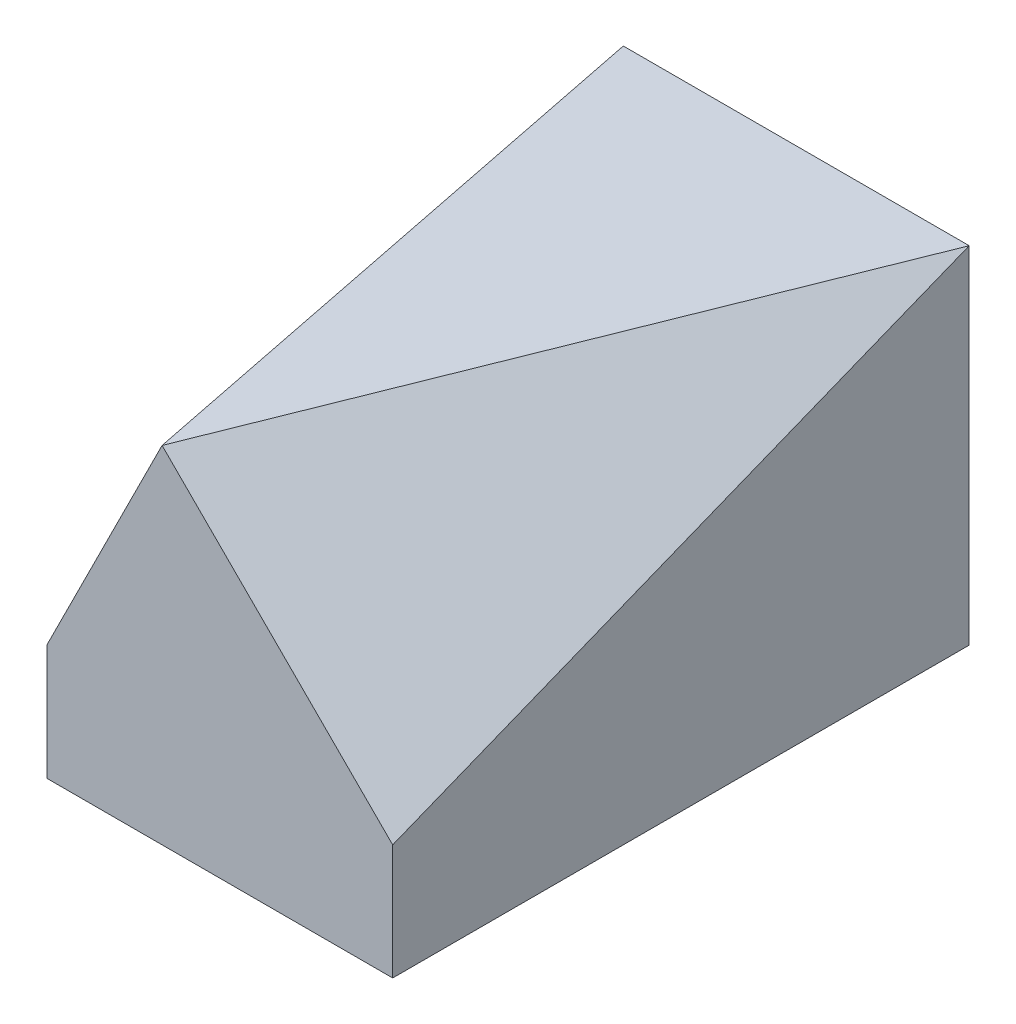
ISO-10303-21;
HEADER;
FILE_DESCRIPTION(('STEP AP214'),'2;1');
FILE_NAME('part.step','',(''),(''),'','','');
FILE_SCHEMA(('AUTOMOTIVE_DESIGN { 1 0 10303 214 1 1 1 1 }'));
ENDSEC;
DATA;
#1=APPLICATION_CONTEXT('core data for automotive mechanical design processes');
#2=APPLICATION_PROTOCOL_DEFINITION('international standard','automotive_design',2000,#1);
#3=PRODUCT_CONTEXT('',#1,'mechanical');
#4=PRODUCT('Part','Part','',(#3));
#5=PRODUCT_RELATED_PRODUCT_CATEGORY('part','',(#4));
#6=PRODUCT_DEFINITION_FORMATION('','',#4);
#7=PRODUCT_DEFINITION_CONTEXT('part definition',#1,'design');
#8=PRODUCT_DEFINITION('design','',#6,#7);
#9=PRODUCT_DEFINITION_SHAPE('','',#8);
#10=(LENGTH_UNIT() NAMED_UNIT(*) SI_UNIT(.MILLI.,.METRE.));
#11=(NAMED_UNIT(*) PLANE_ANGLE_UNIT() SI_UNIT($,.RADIAN.));
#12=(NAMED_UNIT(*) SI_UNIT($,.STERADIAN.) SOLID_ANGLE_UNIT());
#13=UNCERTAINTY_MEASURE_WITH_UNIT(LENGTH_MEASURE(1.E-05),#10,'distance_accuracy_value','');
#14=(GEOMETRIC_REPRESENTATION_CONTEXT(3) GLOBAL_UNCERTAINTY_ASSIGNED_CONTEXT((#13)) GLOBAL_UNIT_ASSIGNED_CONTEXT((#10,
#11,#12)) REPRESENTATION_CONTEXT('',''));
#15=CARTESIAN_POINT('',(0.,0.,0.));
#16=DIRECTION('',(0.,0.,1.));
#17=DIRECTION('',(1.,0.,0.));
#18=AXIS2_PLACEMENT_3D('',#15,#16,#17);
#19=CARTESIAN_POINT('',(-15.,-15.,50.));
#20=DIRECTION('',(1.,0.,0.));
#21=DIRECTION('',(0.,0.,-1.));
#22=AXIS2_PLACEMENT_3D('',#19,#20,#21);
#23=PLANE('',#22);
#24=DIRECTION('',(0.,-0.371390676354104,0.928476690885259));
#25=VECTOR('',#24,1.);
#26=CARTESIAN_POINT('',(-15.,-6.37931034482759,53.448275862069));
#27=LINE('',#26,#25);
#28=CARTESIAN_POINT('',(-15.,15.,0.));
#29=VERTEX_POINT('',#28);
#30=CARTESIAN_POINT('',(-15.,-5.00000000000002,50.));
#31=VERTEX_POINT('',#30);
#32=EDGE_CURVE('E70',#29,#31,#27,.T.);
#33=ORIENTED_EDGE('',*,*,#32,.F.);
#34=DIRECTION('',(0.,-1.,0.));
#35=VECTOR('',#34,1.);
#36=CARTESIAN_POINT('',(-15.,-15.,0.));
#37=LINE('',#36,#35);
#38=CARTESIAN_POINT('',(-15.,-15.,0.));
#39=VERTEX_POINT('',#38);
#40=EDGE_CURVE('E74',#29,#39,#37,.T.);
#41=ORIENTED_EDGE('',*,*,#40,.T.);
#42=DIRECTION('',(0.,0.,-1.));
#43=VECTOR('',#42,1.);
#44=CARTESIAN_POINT('',(-15.,-15.,50.));
#45=LINE('',#44,#43);
#46=CARTESIAN_POINT('',(-15.,-15.,50.));
#47=VERTEX_POINT('',#46);
#48=EDGE_CURVE('E79',#47,#39,#45,.T.);
#49=ORIENTED_EDGE('',*,*,#48,.F.);
#50=DIRECTION('',(0.,-1.,0.));
#51=VECTOR('',#50,1.);
#52=CARTESIAN_POINT('',(-15.,-15.,50.));
#53=LINE('',#52,#51);
#54=EDGE_CURVE('E75',#31,#47,#53,.T.);
#55=ORIENTED_EDGE('',*,*,#54,.F.);
#56=EDGE_LOOP('',(#33,#41,#49,#55));
#57=FACE_BOUND('',#56,.T.);
#58=ADVANCED_FACE('F30',(#57),#23,.F.);
#59=CARTESIAN_POINT('',(-15.,-15.,50.));
#60=DIRECTION('',(0.,1.,0.));
#61=DIRECTION('',(0.,0.,1.));
#62=AXIS2_PLACEMENT_3D('',#59,#60,#61);
#63=PLANE('',#62);
#64=DIRECTION('',(1.,0.,0.));
#65=VECTOR('',#64,1.);
#66=CARTESIAN_POINT('',(-15.,-15.,0.));
#67=LINE('',#66,#65);
#68=CARTESIAN_POINT('',(15.,-15.,0.));
#69=VERTEX_POINT('',#68);
#70=EDGE_CURVE('E94',#39,#69,#67,.T.);
#71=ORIENTED_EDGE('',*,*,#70,.T.);
#72=DIRECTION('',(0.,0.,-1.));
#73=VECTOR('',#72,1.);
#74=CARTESIAN_POINT('',(15.,-15.,50.));
#75=LINE('',#74,#73);
#76=CARTESIAN_POINT('',(15.,-15.,50.));
#77=VERTEX_POINT('',#76);
#78=EDGE_CURVE('E113',#77,#69,#75,.T.);
#79=ORIENTED_EDGE('',*,*,#78,.F.);
#80=DIRECTION('',(1.,0.,0.));
#81=VECTOR('',#80,1.);
#82=CARTESIAN_POINT('',(-15.,-15.,50.));
#83=LINE('',#82,#81);
#84=EDGE_CURVE('E51',#47,#77,#83,.T.);
#85=ORIENTED_EDGE('',*,*,#84,.F.);
#86=ORIENTED_EDGE('',*,*,#48,.T.);
#87=EDGE_LOOP('',(#71,#79,#85,#86));
#88=FACE_BOUND('',#87,.T.);
#89=ADVANCED_FACE('F120',(#88),#63,.F.);
#90=CARTESIAN_POINT('',(15.,-15.,50.));
#91=DIRECTION('',(-1.,0.,0.));
#92=DIRECTION('',(0.,0.,1.));
#93=AXIS2_PLACEMENT_3D('',#90,#91,#92);
#94=PLANE('',#93);
#95=DIRECTION('',(0.,0.371390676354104,-0.928476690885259));
#96=VECTOR('',#95,1.);
#97=CARTESIAN_POINT('',(15.,-6.37931034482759,53.448275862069));
#98=LINE('',#97,#96);
#99=CARTESIAN_POINT('',(15.,-5.,50.));
#100=VERTEX_POINT('',#99);
#101=CARTESIAN_POINT('',(15.,15.,0.));
#102=VERTEX_POINT('',#101);
#103=EDGE_CURVE('E99',#100,#102,#98,.T.);
#104=ORIENTED_EDGE('',*,*,#103,.F.);
#105=DIRECTION('',(0.,1.,0.));
#106=VECTOR('',#105,1.);
#107=CARTESIAN_POINT('',(15.,-15.,50.));
#108=LINE('',#107,#106);
#109=EDGE_CURVE('E109',#77,#100,#108,.T.);
#110=ORIENTED_EDGE('',*,*,#109,.F.);
#111=ORIENTED_EDGE('',*,*,#78,.T.);
#112=DIRECTION('',(0.,1.,0.));
#113=VECTOR('',#112,1.);
#114=CARTESIAN_POINT('',(15.,-15.,0.));
#115=LINE('',#114,#113);
#116=EDGE_CURVE('E91',#69,#102,#115,.T.);
#117=ORIENTED_EDGE('',*,*,#116,.T.);
#118=EDGE_LOOP('',(#104,#110,#111,#117));
#119=FACE_BOUND('',#118,.T.);
#120=ADVANCED_FACE('F115',(#119),#94,.F.);
#121=CARTESIAN_POINT('',(-15.,15.,50.));
#122=DIRECTION('',(0.,-1.,0.));
#123=DIRECTION('',(0.,0.,-1.));
#124=AXIS2_PLACEMENT_3D('',#121,#122,#123);
#125=PLANE('',#124);
#126=DIRECTION('',(-0.371390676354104,0.,0.928476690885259));
#127=VECTOR('',#126,1.);
#128=CARTESIAN_POINT('',(-6.37931034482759,15.,53.448275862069));
#129=LINE('',#128,#127);
#130=CARTESIAN_POINT('',(-5.,15.,50.));
#131=VERTEX_POINT('',#130);
#132=EDGE_CURVE('E37',#102,#131,#129,.T.);
#133=ORIENTED_EDGE('',*,*,#132,.F.);
#134=DIRECTION('',(-1.,0.,0.));
#135=VECTOR('',#134,1.);
#136=CARTESIAN_POINT('',(-15.,15.,0.));
#137=LINE('',#136,#135);
#138=EDGE_CURVE('E84',#102,#29,#137,.T.);
#139=ORIENTED_EDGE('',*,*,#138,.T.);
#140=DIRECTION('',(-0.196116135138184,0.,-0.98058067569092));
#141=VECTOR('',#140,1.);
#142=CARTESIAN_POINT('',(-5.38461538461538,15.,48.0769230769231));
#143=LINE('',#142,#141);
#144=EDGE_CURVE('E78',#131,#29,#143,.T.);
#145=ORIENTED_EDGE('',*,*,#144,.F.);
#146=EDGE_LOOP('',(#133,#139,#145));
#147=FACE_BOUND('',#146,.T.);
#148=ADVANCED_FACE('F85',(#147),#125,.F.);
#149=CARTESIAN_POINT('',(-15.,15.,50.));
#150=DIRECTION('',(0.,0.,-1.));
#151=DIRECTION('',(-1.,0.,0.));
#152=AXIS2_PLACEMENT_3D('',#149,#150,#151);
#153=PLANE('',#152);
#154=DIRECTION('',(0.707106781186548,-0.707106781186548,0.));
#155=VECTOR('',#154,1.);
#156=CARTESIAN_POINT('',(-10.,20.,50.));
#157=LINE('',#156,#155);
#158=EDGE_CURVE('E11',#131,#100,#157,.T.);
#159=ORIENTED_EDGE('',*,*,#158,.F.);
#160=DIRECTION('',(0.447213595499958,0.894427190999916,0.));
#161=VECTOR('',#160,1.);
#162=CARTESIAN_POINT('',(-7.,11.,50.));
#163=LINE('',#162,#161);
#164=EDGE_CURVE('E44',#31,#131,#163,.T.);
#165=ORIENTED_EDGE('',*,*,#164,.F.);
#166=ORIENTED_EDGE('',*,*,#54,.T.);
#167=ORIENTED_EDGE('',*,*,#84,.T.);
#168=ORIENTED_EDGE('',*,*,#109,.T.);
#169=EDGE_LOOP('',(#159,#165,#166,#167,#168));
#170=FACE_BOUND('',#169,.T.);
#171=ADVANCED_FACE('F110',(#170),#153,.F.);
#172=CARTESIAN_POINT('',(-15.,15.,0.));
#173=DIRECTION('',(0.,0.,-1.));
#174=DIRECTION('',(-1.,0.,0.));
#175=AXIS2_PLACEMENT_3D('',#172,#173,#174);
#176=PLANE('',#175);
#177=ORIENTED_EDGE('',*,*,#40,.F.);
#178=ORIENTED_EDGE('',*,*,#138,.F.);
#179=ORIENTED_EDGE('',*,*,#116,.F.);
#180=ORIENTED_EDGE('',*,*,#70,.F.);
#181=EDGE_LOOP('',(#177,#178,#179,#180));
#182=FACE_BOUND('',#181,.T.);
#183=ADVANCED_FACE('F93',(#182),#176,.T.);
#184=CARTESIAN_POINT('',(-4.93333333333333,15.0666666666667,50.1666666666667));
#185=DIRECTION('',(-0.880450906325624,0.440225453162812,0.176090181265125));
#186=DIRECTION('',(-0.447213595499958,-0.894427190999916,0.));
#187=AXIS2_PLACEMENT_3D('',#184,#185,#186);
#188=PLANE('',#187);
#189=ORIENTED_EDGE('',*,*,#144,.T.);
#190=ORIENTED_EDGE('',*,*,#32,.T.);
#191=ORIENTED_EDGE('',*,*,#164,.T.);
#192=EDGE_LOOP('',(#189,#190,#191));
#193=FACE_BOUND('',#192,.T.);
#194=ADVANCED_FACE('F97',(#193),#188,.T.);
#195=CARTESIAN_POINT('',(15.0666666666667,-5.13333333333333,50.1666666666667));
#196=DIRECTION('',(0.680413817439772,0.680413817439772,0.272165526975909));
#197=DIRECTION('',(-0.707106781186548,0.707106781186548,0.));
#198=AXIS2_PLACEMENT_3D('',#195,#196,#197);
#199=PLANE('',#198);
#200=ORIENTED_EDGE('',*,*,#158,.T.);
#201=ORIENTED_EDGE('',*,*,#103,.T.);
#202=ORIENTED_EDGE('',*,*,#132,.T.);
#203=EDGE_LOOP('',(#200,#201,#202));
#204=FACE_BOUND('',#203,.T.);
#205=ADVANCED_FACE('F104',(#204),#199,.T.);
#206=CLOSED_SHELL('',(#58,#89,#120,#148,#171,#183,#194,#205));
#207=MANIFOLD_SOLID_BREP('B2',#206);
#208=ADVANCED_BREP_SHAPE_REPRESENTATION('',(#18,#207),#14);
#209=SHAPE_DEFINITION_REPRESENTATION(#9,#208);
ENDSEC;
END-ISO-10303-21;
